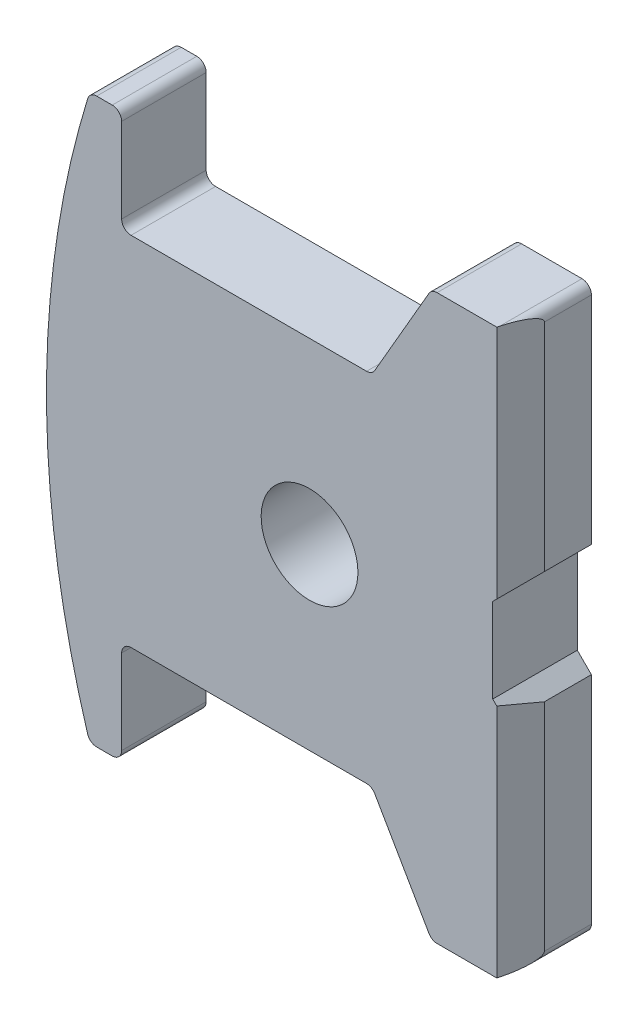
ISO-10303-21;
HEADER;
FILE_DESCRIPTION(('STEP AP214'),'2;1');
FILE_NAME('part.step','',(''),(''),'','','');
FILE_SCHEMA(('AUTOMOTIVE_DESIGN { 1 0 10303 214 1 1 1 1 }'));
ENDSEC;
DATA;
#1=APPLICATION_CONTEXT('core data for automotive mechanical design processes');
#2=APPLICATION_PROTOCOL_DEFINITION('international standard','automotive_design',2000,#1);
#3=PRODUCT_CONTEXT('',#1,'mechanical');
#4=PRODUCT('Part','Part','',(#3));
#5=PRODUCT_RELATED_PRODUCT_CATEGORY('part','',(#4));
#6=PRODUCT_DEFINITION_FORMATION('','',#4);
#7=PRODUCT_DEFINITION_CONTEXT('part definition',#1,'design');
#8=PRODUCT_DEFINITION('design','',#6,#7);
#9=PRODUCT_DEFINITION_SHAPE('','',#8);
#10=(LENGTH_UNIT() NAMED_UNIT(*) SI_UNIT(.MILLI.,.METRE.));
#11=(NAMED_UNIT(*) PLANE_ANGLE_UNIT() SI_UNIT($,.RADIAN.));
#12=(NAMED_UNIT(*) SI_UNIT($,.STERADIAN.) SOLID_ANGLE_UNIT());
#13=UNCERTAINTY_MEASURE_WITH_UNIT(LENGTH_MEASURE(1.E-05),#10,'distance_accuracy_value','');
#14=(GEOMETRIC_REPRESENTATION_CONTEXT(3) GLOBAL_UNCERTAINTY_ASSIGNED_CONTEXT((#13)) GLOBAL_UNIT_ASSIGNED_CONTEXT((#10,
#11,#12)) REPRESENTATION_CONTEXT('',''));
#15=CARTESIAN_POINT('',(0.,0.,0.));
#16=DIRECTION('',(0.,0.,1.));
#17=DIRECTION('',(1.,0.,0.));
#18=AXIS2_PLACEMENT_3D('',#15,#16,#17);
#19=CARTESIAN_POINT('',(-40.,-20.,9.));
#20=DIRECTION('',(0.,0.,-1.));
#21=DIRECTION('',(0.,-1.,0.));
#22=AXIS2_PLACEMENT_3D('',#19,#20,#21);
#23=CYLINDRICAL_SURFACE('',#22,1.);
#24=CARTESIAN_POINT('',(-40.,-20.,0.));
#25=DIRECTION('',(0.,0.,-1.));
#26=DIRECTION('',(0.,1.,0.));
#27=AXIS2_PLACEMENT_3D('',#24,#25,#26);
#28=CIRCLE('',#27,1.);
#29=CARTESIAN_POINT('',(-41.,-20.,0.));
#30=VERTEX_POINT('',#29);
#31=CARTESIAN_POINT('',(-40.,-19.,0.));
#32=VERTEX_POINT('',#31);
#33=EDGE_CURVE('E338',#30,#32,#28,.T.);
#34=ORIENTED_EDGE('',*,*,#33,.T.);
#35=DIRECTION('',(0.,0.,-1.));
#36=VECTOR('',#35,1.);
#37=CARTESIAN_POINT('',(-40.,-19.,9.));
#38=LINE('',#37,#36);
#39=CARTESIAN_POINT('',(-40.,-19.,9.));
#40=VERTEX_POINT('',#39);
#41=EDGE_CURVE('E261',#40,#32,#38,.T.);
#42=ORIENTED_EDGE('',*,*,#41,.F.);
#43=CARTESIAN_POINT('',(-40.,-20.,9.));
#44=DIRECTION('',(0.,0.,-1.));
#45=DIRECTION('',(0.,1.,0.));
#46=AXIS2_PLACEMENT_3D('',#43,#44,#45);
#47=CIRCLE('',#46,1.);
#48=CARTESIAN_POINT('',(-41.,-20.,9.));
#49=VERTEX_POINT('',#48);
#50=EDGE_CURVE('E339',#49,#40,#47,.T.);
#51=ORIENTED_EDGE('',*,*,#50,.F.);
#52=DIRECTION('',(0.,0.,-1.));
#53=VECTOR('',#52,1.);
#54=CARTESIAN_POINT('',(-41.,-20.,9.));
#55=LINE('',#54,#53);
#56=EDGE_CURVE('E380',#49,#30,#55,.T.);
#57=ORIENTED_EDGE('',*,*,#56,.T.);
#58=EDGE_LOOP('',(#34,#42,#51,#57));
#59=FACE_BOUND('',#58,.T.);
#60=ADVANCED_FACE('F14',(#59),#23,.F.);
#61=CARTESIAN_POINT('',(-14.9282032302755,-19.,9.));
#62=DIRECTION('',(0.,1.,0.));
#63=DIRECTION('',(-1.,0.,0.));
#64=AXIS2_PLACEMENT_3D('',#61,#62,#63);
#65=PLANE('',#64);
#66=DIRECTION('',(1.,0.,0.));
#67=VECTOR('',#66,1.);
#68=CARTESIAN_POINT('',(-14.9282032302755,-19.,0.));
#69=LINE('',#68,#67);
#70=CARTESIAN_POINT('',(-14.9282032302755,-19.,0.));
#71=VERTEX_POINT('',#70);
#72=EDGE_CURVE('E383',#32,#71,#69,.T.);
#73=ORIENTED_EDGE('',*,*,#72,.T.);
#74=DIRECTION('',(0.,0.,-1.));
#75=VECTOR('',#74,1.);
#76=CARTESIAN_POINT('',(-14.9282032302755,-19.,9.));
#77=LINE('',#76,#75);
#78=CARTESIAN_POINT('',(-14.9282032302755,-19.,9.));
#79=VERTEX_POINT('',#78);
#80=EDGE_CURVE('E258',#79,#71,#77,.T.);
#81=ORIENTED_EDGE('',*,*,#80,.F.);
#82=DIRECTION('',(1.,0.,0.));
#83=VECTOR('',#82,1.);
#84=CARTESIAN_POINT('',(-14.9282032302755,-19.,9.));
#85=LINE('',#84,#83);
#86=EDGE_CURVE('E342',#40,#79,#85,.T.);
#87=ORIENTED_EDGE('',*,*,#86,.F.);
#88=ORIENTED_EDGE('',*,*,#41,.T.);
#89=EDGE_LOOP('',(#73,#81,#87,#88));
#90=FACE_BOUND('',#89,.T.);
#91=ADVANCED_FACE('F510',(#90),#65,.F.);
#92=CARTESIAN_POINT('',(-14.9282032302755,-20.,9.));
#93=DIRECTION('',(0.,0.,-1.));
#94=DIRECTION('',(0.,-1.,0.));
#95=AXIS2_PLACEMENT_3D('',#92,#93,#94);
#96=CYLINDRICAL_SURFACE('',#95,1.);
#97=CARTESIAN_POINT('',(-14.9282032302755,-20.,0.));
#98=DIRECTION('',(0.,0.,-1.));
#99=DIRECTION('',(0.,1.,0.));
#100=AXIS2_PLACEMENT_3D('',#97,#98,#99);
#101=CIRCLE('',#100,1.);
#102=CARTESIAN_POINT('',(-14.062177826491,-19.5,0.));
#103=VERTEX_POINT('',#102);
#104=EDGE_CURVE('E385',#71,#103,#101,.T.);
#105=ORIENTED_EDGE('',*,*,#104,.T.);
#106=DIRECTION('',(0.,0.,-1.));
#107=VECTOR('',#106,1.);
#108=CARTESIAN_POINT('',(-14.062177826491,-19.5,9.));
#109=LINE('',#108,#107);
#110=CARTESIAN_POINT('',(-14.062177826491,-19.5,9.));
#111=VERTEX_POINT('',#110);
#112=EDGE_CURVE('E255',#111,#103,#109,.T.);
#113=ORIENTED_EDGE('',*,*,#112,.F.);
#114=CARTESIAN_POINT('',(-14.9282032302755,-20.,9.));
#115=DIRECTION('',(0.,0.,-1.));
#116=DIRECTION('',(0.,1.,0.));
#117=AXIS2_PLACEMENT_3D('',#114,#115,#116);
#118=CIRCLE('',#117,1.);
#119=EDGE_CURVE('E345',#79,#111,#118,.T.);
#120=ORIENTED_EDGE('',*,*,#119,.F.);
#121=ORIENTED_EDGE('',*,*,#80,.T.);
#122=EDGE_LOOP('',(#105,#113,#120,#121));
#123=FACE_BOUND('',#122,.T.);
#124=ADVANCED_FACE('F516',(#123),#96,.F.);
#125=CARTESIAN_POINT('',(-8.2886751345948,-29.5,9.));
#126=DIRECTION('',(0.866025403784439,0.5,0.));
#127=DIRECTION('',(-0.5,0.86602540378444,0.));
#128=AXIS2_PLACEMENT_3D('',#125,#126,#127);
#129=PLANE('',#128);
#130=DIRECTION('',(0.5,-0.86602540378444,0.));
#131=VECTOR('',#130,1.);
#132=CARTESIAN_POINT('',(-8.2886751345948,-29.5,0.));
#133=LINE('',#132,#131);
#134=CARTESIAN_POINT('',(-8.2886751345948,-29.5,0.));
#135=VERTEX_POINT('',#134);
#136=EDGE_CURVE('E387',#103,#135,#133,.T.);
#137=ORIENTED_EDGE('',*,*,#136,.T.);
#138=DIRECTION('',(0.,0.,-1.));
#139=VECTOR('',#138,1.);
#140=CARTESIAN_POINT('',(-8.2886751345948,-29.5,9.));
#141=LINE('',#140,#139);
#142=CARTESIAN_POINT('',(-8.2886751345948,-29.5,9.));
#143=VERTEX_POINT('',#142);
#144=EDGE_CURVE('E246',#143,#135,#141,.T.);
#145=ORIENTED_EDGE('',*,*,#144,.F.);
#146=DIRECTION('',(0.5,-0.86602540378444,0.));
#147=VECTOR('',#146,1.);
#148=CARTESIAN_POINT('',(-8.2886751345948,-29.5,9.));
#149=LINE('',#148,#147);
#150=EDGE_CURVE('E347',#111,#143,#149,.T.);
#151=ORIENTED_EDGE('',*,*,#150,.F.);
#152=ORIENTED_EDGE('',*,*,#112,.T.);
#153=EDGE_LOOP('',(#137,#145,#151,#152));
#154=FACE_BOUND('',#153,.T.);
#155=ADVANCED_FACE('F522',(#154),#129,.F.);
#156=CARTESIAN_POINT('',(-7.42264973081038,-29.,9.));
#157=DIRECTION('',(0.,0.,-1.));
#158=DIRECTION('',(0.,-1.,0.));
#159=AXIS2_PLACEMENT_3D('',#156,#157,#158);
#160=CYLINDRICAL_SURFACE('',#159,1.);
#161=CARTESIAN_POINT('',(-7.42264973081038,-29.,0.));
#162=DIRECTION('',(0.,0.,1.));
#163=DIRECTION('',(0.,-1.,0.));
#164=AXIS2_PLACEMENT_3D('',#161,#162,#163);
#165=CIRCLE('',#164,1.);
#166=CARTESIAN_POINT('',(-7.42264973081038,-30.,0.));
#167=VERTEX_POINT('',#166);
#168=EDGE_CURVE('E389',#135,#167,#165,.T.);
#169=ORIENTED_EDGE('',*,*,#168,.T.);
#170=DIRECTION('',(0.,0.,-1.));
#171=VECTOR('',#170,1.);
#172=CARTESIAN_POINT('',(-7.42264973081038,-30.,9.));
#173=LINE('',#172,#171);
#174=CARTESIAN_POINT('',(-7.42264973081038,-30.,9.));
#175=VERTEX_POINT('',#174);
#176=EDGE_CURVE('E242',#175,#167,#173,.T.);
#177=ORIENTED_EDGE('',*,*,#176,.F.);
#178=CARTESIAN_POINT('',(-7.42264973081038,-29.,9.));
#179=DIRECTION('',(0.,0.,1.));
#180=DIRECTION('',(0.,-1.,0.));
#181=AXIS2_PLACEMENT_3D('',#178,#179,#180);
#182=CIRCLE('',#181,1.);
#183=EDGE_CURVE('E349',#143,#175,#182,.T.);
#184=ORIENTED_EDGE('',*,*,#183,.F.);
#185=ORIENTED_EDGE('',*,*,#144,.T.);
#186=EDGE_LOOP('',(#169,#177,#184,#185));
#187=FACE_BOUND('',#186,.T.);
#188=ADVANCED_FACE('F526',(#187),#160,.T.);
#189=CARTESIAN_POINT('',(0.,-30.,9.));
#190=DIRECTION('',(0.,1.,0.));
#191=DIRECTION('',(-1.,0.,0.));
#192=AXIS2_PLACEMENT_3D('',#189,#190,#191);
#193=PLANE('',#192);
#194=DIRECTION('',(1.,0.,0.));
#195=VECTOR('',#194,1.);
#196=CARTESIAN_POINT('',(0.,-30.,0.));
#197=LINE('',#196,#195);
#198=CARTESIAN_POINT('',(-1.,-30.,0.));
#199=VERTEX_POINT('',#198);
#200=EDGE_CURVE('E391',#167,#199,#197,.T.);
#201=ORIENTED_EDGE('',*,*,#200,.T.);
#202=DIRECTION('',(0.,0.,-1.));
#203=VECTOR('',#202,1.);
#204=CARTESIAN_POINT('',(-1.,-30.,9.));
#205=LINE('',#204,#203);
#206=CARTESIAN_POINT('',(-1.,-30.,8.73205080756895));
#207=VERTEX_POINT('',#206);
#208=EDGE_CURVE('E273',#199,#207,#205,.F.);
#209=ORIENTED_EDGE('',*,*,#208,.T.);
#210=DIRECTION('',(-0.258819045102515,0.,0.96592582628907));
#211=VECTOR('',#210,1.);
#212=CARTESIAN_POINT('',(-1.,-30.,8.73205080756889));
#213=LINE('',#212,#211);
#214=CARTESIAN_POINT('',(-1.07179676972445,-30.,9.));
#215=VERTEX_POINT('',#214);
#216=EDGE_CURVE('E236',#207,#215,#213,.T.);
#217=ORIENTED_EDGE('',*,*,#216,.T.);
#218=DIRECTION('',(1.,0.,0.));
#219=VECTOR('',#218,1.);
#220=CARTESIAN_POINT('',(0.,-30.,9.));
#221=LINE('',#220,#219);
#222=EDGE_CURVE('E351',#175,#215,#221,.T.);
#223=ORIENTED_EDGE('',*,*,#222,.F.);
#224=ORIENTED_EDGE('',*,*,#176,.T.);
#225=EDGE_LOOP('',(#201,#209,#217,#223,#224));
#226=FACE_BOUND('',#225,.T.);
#227=ADVANCED_FACE('F493',(#226),#193,.F.);
#228=CARTESIAN_POINT('',(0.,-6.,9.));
#229=DIRECTION('',(-1.,0.,0.));
#230=DIRECTION('',(0.,-1.,0.));
#231=AXIS2_PLACEMENT_3D('',#228,#229,#230);
#232=PLANE('',#231);
#233=DIRECTION('',(0.,1.,0.));
#234=VECTOR('',#233,1.);
#235=CARTESIAN_POINT('',(0.,-40.,5.));
#236=LINE('',#235,#234);
#237=CARTESIAN_POINT('',(0.,-29.,5.));
#238=VERTEX_POINT('',#237);
#239=CARTESIAN_POINT('',(0.,-6.,5.));
#240=VERTEX_POINT('',#239);
#241=EDGE_CURVE('E212',#238,#240,#236,.T.);
#242=ORIENTED_EDGE('',*,*,#241,.F.);
#243=DIRECTION('',(0.,0.,-1.));
#244=VECTOR('',#243,1.);
#245=CARTESIAN_POINT('',(0.,-29.,9.));
#246=LINE('',#245,#244);
#247=CARTESIAN_POINT('',(0.,-29.,0.));
#248=VERTEX_POINT('',#247);
#249=EDGE_CURVE('E267',#238,#248,#246,.T.);
#250=ORIENTED_EDGE('',*,*,#249,.T.);
#251=DIRECTION('',(0.,1.,0.));
#252=VECTOR('',#251,1.);
#253=CARTESIAN_POINT('',(0.,-6.,0.));
#254=LINE('',#253,#252);
#255=CARTESIAN_POINT('',(0.,-6.,0.));
#256=VERTEX_POINT('',#255);
#257=EDGE_CURVE('E241',#248,#256,#254,.T.);
#258=ORIENTED_EDGE('',*,*,#257,.T.);
#259=DIRECTION('',(0.,0.,-1.));
#260=VECTOR('',#259,1.);
#261=CARTESIAN_POINT('',(0.,-6.,9.));
#262=LINE('',#261,#260);
#263=EDGE_CURVE('E232',#240,#256,#262,.T.);
#264=ORIENTED_EDGE('',*,*,#263,.F.);
#265=EDGE_LOOP('',(#242,#250,#258,#264));
#266=FACE_BOUND('',#265,.T.);
#267=ADVANCED_FACE('F239',(#266),#232,.F.);
#268=CARTESIAN_POINT('',(0.,-6.,9.));
#269=DIRECTION('',(-0.707106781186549,-0.707106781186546,0.));
#270=DIRECTION('',(0.707106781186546,-0.707106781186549,0.));
#271=AXIS2_PLACEMENT_3D('',#268,#269,#270);
#272=PLANE('',#271);
#273=DIRECTION('',(-0.707106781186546,0.707106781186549,0.));
#274=VECTOR('',#273,1.);
#275=CARTESIAN_POINT('',(0.,-6.,9.));
#276=LINE('',#275,#274);
#277=CARTESIAN_POINT('',(-1.07179676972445,-4.92820323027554,9.));
#278=VERTEX_POINT('',#277);
#279=CARTESIAN_POINT('',(-1.5,-4.5,9.));
#280=VERTEX_POINT('',#279);
#281=EDGE_CURVE('E235',#278,#280,#276,.T.);
#282=ORIENTED_EDGE('',*,*,#281,.F.);
#283=DIRECTION('',(0.250562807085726,-0.250562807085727,-0.935113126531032));
#284=VECTOR('',#283,1.);
#285=CARTESIAN_POINT('',(-0.937218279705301,-5.0627817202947,8.49774623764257));
#286=LINE('',#285,#284);
#287=EDGE_CURVE('E217',#278,#240,#286,.T.);
#288=ORIENTED_EDGE('',*,*,#287,.T.);
#289=ORIENTED_EDGE('',*,*,#263,.T.);
#290=DIRECTION('',(-0.707106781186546,0.707106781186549,0.));
#291=VECTOR('',#290,1.);
#292=CARTESIAN_POINT('',(0.,-6.,0.));
#293=LINE('',#292,#291);
#294=CARTESIAN_POINT('',(-1.5,-4.5,0.));
#295=VERTEX_POINT('',#294);
#296=EDGE_CURVE('E395',#256,#295,#293,.T.);
#297=ORIENTED_EDGE('',*,*,#296,.T.);
#298=DIRECTION('',(0.,0.,-1.));
#299=VECTOR('',#298,1.);
#300=CARTESIAN_POINT('',(-1.5,-4.5,9.));
#301=LINE('',#300,#299);
#302=EDGE_CURVE('E243',#280,#295,#301,.T.);
#303=ORIENTED_EDGE('',*,*,#302,.F.);
#304=EDGE_LOOP('',(#282,#288,#289,#297,#303));
#305=FACE_BOUND('',#304,.T.);
#306=ADVANCED_FACE('F231',(#305),#272,.F.);
#307=CARTESIAN_POINT('',(-1.5,-4.5,9.));
#308=DIRECTION('',(-1.,0.,0.));
#309=DIRECTION('',(0.,-1.,0.));
#310=AXIS2_PLACEMENT_3D('',#307,#308,#309);
#311=PLANE('',#310);
#312=DIRECTION('',(0.,1.,0.));
#313=VECTOR('',#312,1.);
#314=CARTESIAN_POINT('',(-1.5,-4.5,0.));
#315=LINE('',#314,#313);
#316=CARTESIAN_POINT('',(-1.5,4.5,0.));
#317=VERTEX_POINT('',#316);
#318=EDGE_CURVE('E397',#295,#317,#315,.T.);
#319=ORIENTED_EDGE('',*,*,#318,.T.);
#320=DIRECTION('',(0.,0.,-1.));
#321=VECTOR('',#320,1.);
#322=CARTESIAN_POINT('',(-1.5,4.5,9.));
#323=LINE('',#322,#321);
#324=CARTESIAN_POINT('',(-1.5,4.5,9.));
#325=VERTEX_POINT('',#324);
#326=EDGE_CURVE('E249',#325,#317,#323,.T.);
#327=ORIENTED_EDGE('',*,*,#326,.F.);
#328=DIRECTION('',(0.,1.,0.));
#329=VECTOR('',#328,1.);
#330=CARTESIAN_POINT('',(-1.5,-4.5,9.));
#331=LINE('',#330,#329);
#332=EDGE_CURVE('E355',#280,#325,#331,.T.);
#333=ORIENTED_EDGE('',*,*,#332,.F.);
#334=ORIENTED_EDGE('',*,*,#302,.T.);
#335=EDGE_LOOP('',(#319,#327,#333,#334));
#336=FACE_BOUND('',#335,.T.);
#337=ADVANCED_FACE('F487',(#336),#311,.F.);
#338=CARTESIAN_POINT('',(0.,6.,9.));
#339=DIRECTION('',(-0.707106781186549,0.707106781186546,0.));
#340=DIRECTION('',(-0.707106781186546,-0.707106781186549,0.));
#341=AXIS2_PLACEMENT_3D('',#338,#339,#340);
#342=PLANE('',#341);
#343=DIRECTION('',(0.,0.,-1.));
#344=VECTOR('',#343,1.);
#345=CARTESIAN_POINT('',(0.,6.,9.));
#346=LINE('',#345,#344);
#347=CARTESIAN_POINT('',(0.,6.,5.));
#348=VERTEX_POINT('',#347);
#349=CARTESIAN_POINT('',(0.,6.,0.));
#350=VERTEX_POINT('',#349);
#351=EDGE_CURVE('E457',#348,#350,#346,.T.);
#352=ORIENTED_EDGE('',*,*,#351,.F.);
#353=DIRECTION('',(-0.250562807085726,-0.250562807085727,0.935113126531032));
#354=VECTOR('',#353,1.);
#355=CARTESIAN_POINT('',(-0.937218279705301,5.06278172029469,8.49774623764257));
#356=LINE('',#355,#354);
#357=CARTESIAN_POINT('',(-1.07179676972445,4.92820323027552,9.));
#358=VERTEX_POINT('',#357);
#359=EDGE_CURVE('E237',#348,#358,#356,.T.);
#360=ORIENTED_EDGE('',*,*,#359,.T.);
#361=DIRECTION('',(0.707106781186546,0.707106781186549,0.));
#362=VECTOR('',#361,1.);
#363=CARTESIAN_POINT('',(0.,6.,9.));
#364=LINE('',#363,#362);
#365=EDGE_CURVE('E357',#325,#358,#364,.T.);
#366=ORIENTED_EDGE('',*,*,#365,.F.);
#367=ORIENTED_EDGE('',*,*,#326,.T.);
#368=DIRECTION('',(0.707106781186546,0.707106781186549,0.));
#369=VECTOR('',#368,1.);
#370=CARTESIAN_POINT('',(0.,6.,0.));
#371=LINE('',#370,#369);
#372=EDGE_CURVE('E399',#317,#350,#371,.T.);
#373=ORIENTED_EDGE('',*,*,#372,.T.);
#374=EDGE_LOOP('',(#352,#360,#366,#367,#373));
#375=FACE_BOUND('',#374,.T.);
#376=ADVANCED_FACE('F464',(#375),#342,.F.);
#377=CARTESIAN_POINT('',(0.,30.,9.));
#378=DIRECTION('',(-1.,0.,0.));
#379=DIRECTION('',(0.,-1.,0.));
#380=AXIS2_PLACEMENT_3D('',#377,#378,#379);
#381=PLANE('',#380);
#382=DIRECTION('',(0.,1.,0.));
#383=VECTOR('',#382,1.);
#384=CARTESIAN_POINT('',(0.,30.,0.));
#385=LINE('',#384,#383);
#386=CARTESIAN_POINT('',(0.,29.,0.));
#387=VERTEX_POINT('',#386);
#388=EDGE_CURVE('E402',#350,#387,#385,.T.);
#389=ORIENTED_EDGE('',*,*,#388,.T.);
#390=DIRECTION('',(0.,0.,-1.));
#391=VECTOR('',#390,1.);
#392=CARTESIAN_POINT('',(0.,29.,9.));
#393=LINE('',#392,#391);
#394=CARTESIAN_POINT('',(0.,29.,5.));
#395=VERTEX_POINT('',#394);
#396=EDGE_CURVE('E279',#387,#395,#393,.F.);
#397=ORIENTED_EDGE('',*,*,#396,.T.);
#398=EDGE_CURVE('E226',#348,#395,#236,.T.);
#399=ORIENTED_EDGE('',*,*,#398,.F.);
#400=ORIENTED_EDGE('',*,*,#351,.T.);
#401=EDGE_LOOP('',(#389,#397,#399,#400));
#402=FACE_BOUND('',#401,.T.);
#403=ADVANCED_FACE('F472',(#402),#381,.F.);
#404=CARTESIAN_POINT('',(-7.42264973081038,30.,9.));
#405=DIRECTION('',(0.,-1.,0.));
#406=DIRECTION('',(1.,0.,0.));
#407=AXIS2_PLACEMENT_3D('',#404,#405,#406);
#408=PLANE('',#407);
#409=DIRECTION('',(0.258819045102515,0.,-0.96592582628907));
#410=VECTOR('',#409,1.);
#411=CARTESIAN_POINT('',(-1.4972232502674,30.,10.5877132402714));
#412=LINE('',#411,#410);
#413=CARTESIAN_POINT('',(-1.07179676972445,30.,9.));
#414=VERTEX_POINT('',#413);
#415=CARTESIAN_POINT('',(-1.,30.,8.73205080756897));
#416=VERTEX_POINT('',#415);
#417=EDGE_CURVE('E225',#414,#416,#412,.T.);
#418=ORIENTED_EDGE('',*,*,#417,.T.);
#419=DIRECTION('',(0.,0.,-1.));
#420=VECTOR('',#419,1.);
#421=CARTESIAN_POINT('',(-1.,30.,9.));
#422=LINE('',#421,#420);
#423=CARTESIAN_POINT('',(-1.,30.,0.));
#424=VERTEX_POINT('',#423);
#425=EDGE_CURVE('E276',#416,#424,#422,.T.);
#426=ORIENTED_EDGE('',*,*,#425,.T.);
#427=DIRECTION('',(-1.,0.,0.));
#428=VECTOR('',#427,1.);
#429=CARTESIAN_POINT('',(-7.42264973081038,30.,0.));
#430=LINE('',#429,#428);
#431=CARTESIAN_POINT('',(-7.42264973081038,30.,0.));
#432=VERTEX_POINT('',#431);
#433=EDGE_CURVE('E405',#424,#432,#430,.T.);
#434=ORIENTED_EDGE('',*,*,#433,.T.);
#435=DIRECTION('',(0.,0.,-1.));
#436=VECTOR('',#435,1.);
#437=CARTESIAN_POINT('',(-7.42264973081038,30.,9.));
#438=LINE('',#437,#436);
#439=CARTESIAN_POINT('',(-7.42264973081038,30.,9.));
#440=VERTEX_POINT('',#439);
#441=EDGE_CURVE('E454',#440,#432,#438,.T.);
#442=ORIENTED_EDGE('',*,*,#441,.F.);
#443=DIRECTION('',(-1.,0.,0.));
#444=VECTOR('',#443,1.);
#445=CARTESIAN_POINT('',(-7.42264973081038,30.,9.));
#446=LINE('',#445,#444);
#447=EDGE_CURVE('E360',#414,#440,#446,.T.);
#448=ORIENTED_EDGE('',*,*,#447,.F.);
#449=EDGE_LOOP('',(#418,#426,#434,#442,#448));
#450=FACE_BOUND('',#449,.T.);
#451=ADVANCED_FACE('F483',(#450),#408,.F.);
#452=CARTESIAN_POINT('',(-7.42264973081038,29.,9.));
#453=DIRECTION('',(0.,0.,-1.));
#454=DIRECTION('',(0.,-1.,0.));
#455=AXIS2_PLACEMENT_3D('',#452,#453,#454);
#456=CYLINDRICAL_SURFACE('',#455,1.);
#457=CARTESIAN_POINT('',(-7.42264973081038,29.,0.));
#458=DIRECTION('',(0.,0.,1.));
#459=DIRECTION('',(0.,1.,0.));
#460=AXIS2_PLACEMENT_3D('',#457,#458,#459);
#461=CIRCLE('',#460,1.);
#462=CARTESIAN_POINT('',(-8.2886751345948,29.5,0.));
#463=VERTEX_POINT('',#462);
#464=EDGE_CURVE('E407',#432,#463,#461,.T.);
#465=ORIENTED_EDGE('',*,*,#464,.T.);
#466=DIRECTION('',(0.,0.,-1.));
#467=VECTOR('',#466,1.);
#468=CARTESIAN_POINT('',(-8.2886751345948,29.5,9.));
#469=LINE('',#468,#467);
#470=CARTESIAN_POINT('',(-8.2886751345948,29.5,9.));
#471=VERTEX_POINT('',#470);
#472=EDGE_CURVE('E451',#471,#463,#469,.T.);
#473=ORIENTED_EDGE('',*,*,#472,.F.);
#474=CARTESIAN_POINT('',(-7.42264973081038,29.,9.));
#475=DIRECTION('',(0.,0.,1.));
#476=DIRECTION('',(0.,1.,0.));
#477=AXIS2_PLACEMENT_3D('',#474,#475,#476);
#478=CIRCLE('',#477,1.);
#479=EDGE_CURVE('E362',#440,#471,#478,.T.);
#480=ORIENTED_EDGE('',*,*,#479,.F.);
#481=ORIENTED_EDGE('',*,*,#441,.T.);
#482=EDGE_LOOP('',(#465,#473,#480,#481));
#483=FACE_BOUND('',#482,.T.);
#484=ADVANCED_FACE('F545',(#483),#456,.T.);
#485=CARTESIAN_POINT('',(-14.062177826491,19.5,9.));
#486=DIRECTION('',(0.86602540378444,-0.5,0.));
#487=DIRECTION('',(0.5,0.86602540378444,0.));
#488=AXIS2_PLACEMENT_3D('',#485,#486,#487);
#489=PLANE('',#488);
#490=DIRECTION('',(-0.5,-0.86602540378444,0.));
#491=VECTOR('',#490,1.);
#492=CARTESIAN_POINT('',(-14.062177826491,19.5,0.));
#493=LINE('',#492,#491);
#494=CARTESIAN_POINT('',(-14.062177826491,19.5,0.));
#495=VERTEX_POINT('',#494);
#496=EDGE_CURVE('E409',#463,#495,#493,.T.);
#497=ORIENTED_EDGE('',*,*,#496,.T.);
#498=DIRECTION('',(0.,0.,-1.));
#499=VECTOR('',#498,1.);
#500=CARTESIAN_POINT('',(-14.062177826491,19.5,9.));
#501=LINE('',#500,#499);
#502=CARTESIAN_POINT('',(-14.062177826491,19.5,9.));
#503=VERTEX_POINT('',#502);
#504=EDGE_CURVE('E448',#503,#495,#501,.T.);
#505=ORIENTED_EDGE('',*,*,#504,.F.);
#506=DIRECTION('',(-0.5,-0.86602540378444,0.));
#507=VECTOR('',#506,1.);
#508=CARTESIAN_POINT('',(-14.062177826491,19.5,9.));
#509=LINE('',#508,#507);
#510=EDGE_CURVE('E364',#471,#503,#509,.T.);
#511=ORIENTED_EDGE('',*,*,#510,.F.);
#512=ORIENTED_EDGE('',*,*,#472,.T.);
#513=EDGE_LOOP('',(#497,#505,#511,#512));
#514=FACE_BOUND('',#513,.T.);
#515=ADVANCED_FACE('F548',(#514),#489,.F.);
#516=CARTESIAN_POINT('',(-14.9282032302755,20.,9.));
#517=DIRECTION('',(0.,0.,-1.));
#518=DIRECTION('',(0.,-1.,0.));
#519=AXIS2_PLACEMENT_3D('',#516,#517,#518);
#520=CYLINDRICAL_SURFACE('',#519,1.);
#521=CARTESIAN_POINT('',(-14.9282032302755,20.,0.));
#522=DIRECTION('',(0.,0.,-1.));
#523=DIRECTION('',(0.,-1.,0.));
#524=AXIS2_PLACEMENT_3D('',#521,#522,#523);
#525=CIRCLE('',#524,1.);
#526=CARTESIAN_POINT('',(-14.9282032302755,19.,0.));
#527=VERTEX_POINT('',#526);
#528=EDGE_CURVE('E411',#495,#527,#525,.T.);
#529=ORIENTED_EDGE('',*,*,#528,.T.);
#530=DIRECTION('',(0.,0.,-1.));
#531=VECTOR('',#530,1.);
#532=CARTESIAN_POINT('',(-14.9282032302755,19.,9.));
#533=LINE('',#532,#531);
#534=CARTESIAN_POINT('',(-14.9282032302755,19.,9.));
#535=VERTEX_POINT('',#534);
#536=EDGE_CURVE('E445',#535,#527,#533,.T.);
#537=ORIENTED_EDGE('',*,*,#536,.F.);
#538=CARTESIAN_POINT('',(-14.9282032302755,20.,9.));
#539=DIRECTION('',(0.,0.,-1.));
#540=DIRECTION('',(0.,-1.,0.));
#541=AXIS2_PLACEMENT_3D('',#538,#539,#540);
#542=CIRCLE('',#541,1.);
#543=EDGE_CURVE('E366',#503,#535,#542,.T.);
#544=ORIENTED_EDGE('',*,*,#543,.F.);
#545=ORIENTED_EDGE('',*,*,#504,.T.);
#546=EDGE_LOOP('',(#529,#537,#544,#545));
#547=FACE_BOUND('',#546,.T.);
#548=ADVANCED_FACE('F552',(#547),#520,.F.);
#549=CARTESIAN_POINT('',(-40.,19.,9.));
#550=DIRECTION('',(0.,-1.,0.));
#551=DIRECTION('',(1.,0.,0.));
#552=AXIS2_PLACEMENT_3D('',#549,#550,#551);
#553=PLANE('',#552);
#554=DIRECTION('',(-1.,0.,0.));
#555=VECTOR('',#554,1.);
#556=CARTESIAN_POINT('',(-40.,19.,0.));
#557=LINE('',#556,#555);
#558=CARTESIAN_POINT('',(-40.,19.,0.));
#559=VERTEX_POINT('',#558);
#560=EDGE_CURVE('E413',#527,#559,#557,.T.);
#561=ORIENTED_EDGE('',*,*,#560,.T.);
#562=DIRECTION('',(0.,0.,-1.));
#563=VECTOR('',#562,1.);
#564=CARTESIAN_POINT('',(-40.,19.,9.));
#565=LINE('',#564,#563);
#566=CARTESIAN_POINT('',(-40.,19.,9.));
#567=VERTEX_POINT('',#566);
#568=EDGE_CURVE('E442',#567,#559,#565,.T.);
#569=ORIENTED_EDGE('',*,*,#568,.F.);
#570=DIRECTION('',(-1.,0.,0.));
#571=VECTOR('',#570,1.);
#572=CARTESIAN_POINT('',(-40.,19.,9.));
#573=LINE('',#572,#571);
#574=EDGE_CURVE('E368',#535,#567,#573,.T.);
#575=ORIENTED_EDGE('',*,*,#574,.F.);
#576=ORIENTED_EDGE('',*,*,#536,.T.);
#577=EDGE_LOOP('',(#561,#569,#575,#576));
#578=FACE_BOUND('',#577,.T.);
#579=ADVANCED_FACE('F556',(#578),#553,.F.);
#580=CARTESIAN_POINT('',(-40.,20.,9.));
#581=DIRECTION('',(0.,0.,-1.));
#582=DIRECTION('',(0.,-1.,0.));
#583=AXIS2_PLACEMENT_3D('',#580,#581,#582);
#584=CYLINDRICAL_SURFACE('',#583,1.);
#585=CARTESIAN_POINT('',(-40.,20.,0.));
#586=DIRECTION('',(0.,0.,-1.));
#587=DIRECTION('',(0.,-1.,0.));
#588=AXIS2_PLACEMENT_3D('',#585,#586,#587);
#589=CIRCLE('',#588,1.);
#590=CARTESIAN_POINT('',(-41.,20.,0.));
#591=VERTEX_POINT('',#590);
#592=EDGE_CURVE('E415',#559,#591,#589,.T.);
#593=ORIENTED_EDGE('',*,*,#592,.T.);
#594=DIRECTION('',(0.,0.,-1.));
#595=VECTOR('',#594,1.);
#596=CARTESIAN_POINT('',(-41.,20.,9.));
#597=LINE('',#596,#595);
#598=CARTESIAN_POINT('',(-41.,20.,9.));
#599=VERTEX_POINT('',#598);
#600=EDGE_CURVE('E439',#599,#591,#597,.T.);
#601=ORIENTED_EDGE('',*,*,#600,.F.);
#602=CARTESIAN_POINT('',(-40.,20.,9.));
#603=DIRECTION('',(0.,0.,-1.));
#604=DIRECTION('',(0.,-1.,0.));
#605=AXIS2_PLACEMENT_3D('',#602,#603,#604);
#606=CIRCLE('',#605,1.);
#607=EDGE_CURVE('E370',#567,#599,#606,.T.);
#608=ORIENTED_EDGE('',*,*,#607,.F.);
#609=ORIENTED_EDGE('',*,*,#568,.T.);
#610=EDGE_LOOP('',(#593,#601,#608,#609));
#611=FACE_BOUND('',#610,.T.);
#612=ADVANCED_FACE('F560',(#611),#584,.F.);
#613=CARTESIAN_POINT('',(-41.,29.,9.));
#614=DIRECTION('',(-1.,0.,0.));
#615=DIRECTION('',(0.,-1.,0.));
#616=AXIS2_PLACEMENT_3D('',#613,#614,#615);
#617=PLANE('',#616);
#618=DIRECTION('',(0.,1.,0.));
#619=VECTOR('',#618,1.);
#620=CARTESIAN_POINT('',(-41.,29.,0.));
#621=LINE('',#620,#619);
#622=CARTESIAN_POINT('',(-41.,29.,0.));
#623=VERTEX_POINT('',#622);
#624=EDGE_CURVE('E417',#591,#623,#621,.T.);
#625=ORIENTED_EDGE('',*,*,#624,.T.);
#626=DIRECTION('',(0.,0.,-1.));
#627=VECTOR('',#626,1.);
#628=CARTESIAN_POINT('',(-41.,29.,9.));
#629=LINE('',#628,#627);
#630=CARTESIAN_POINT('',(-41.,29.,9.));
#631=VERTEX_POINT('',#630);
#632=EDGE_CURVE('E436',#631,#623,#629,.T.);
#633=ORIENTED_EDGE('',*,*,#632,.F.);
#634=DIRECTION('',(0.,1.,0.));
#635=VECTOR('',#634,1.);
#636=CARTESIAN_POINT('',(-41.,29.,9.));
#637=LINE('',#636,#635);
#638=EDGE_CURVE('E372',#599,#631,#637,.T.);
#639=ORIENTED_EDGE('',*,*,#638,.F.);
#640=ORIENTED_EDGE('',*,*,#600,.T.);
#641=EDGE_LOOP('',(#625,#633,#639,#640));
#642=FACE_BOUND('',#641,.T.);
#643=ADVANCED_FACE('F564',(#642),#617,.F.);
#644=CARTESIAN_POINT('',(-42.,29.,9.));
#645=DIRECTION('',(0.,0.,-1.));
#646=DIRECTION('',(0.,-1.,0.));
#647=AXIS2_PLACEMENT_3D('',#644,#645,#646);
#648=CYLINDRICAL_SURFACE('',#647,1.);
#649=CARTESIAN_POINT('',(-42.,29.,0.));
#650=DIRECTION('',(0.,0.,1.));
#651=DIRECTION('',(0.,1.,0.));
#652=AXIS2_PLACEMENT_3D('',#649,#650,#651);
#653=CIRCLE('',#652,1.);
#654=CARTESIAN_POINT('',(-42.,30.,0.));
#655=VERTEX_POINT('',#654);
#656=EDGE_CURVE('E419',#623,#655,#653,.T.);
#657=ORIENTED_EDGE('',*,*,#656,.T.);
#658=DIRECTION('',(0.,0.,-1.));
#659=VECTOR('',#658,1.);
#660=CARTESIAN_POINT('',(-42.,30.,9.));
#661=LINE('',#660,#659);
#662=CARTESIAN_POINT('',(-42.,30.,9.));
#663=VERTEX_POINT('',#662);
#664=EDGE_CURVE('E433',#663,#655,#661,.T.);
#665=ORIENTED_EDGE('',*,*,#664,.F.);
#666=CARTESIAN_POINT('',(-42.,29.,9.));
#667=DIRECTION('',(0.,0.,1.));
#668=DIRECTION('',(0.,1.,0.));
#669=AXIS2_PLACEMENT_3D('',#666,#667,#668);
#670=CIRCLE('',#669,1.);
#671=EDGE_CURVE('E374',#631,#663,#670,.T.);
#672=ORIENTED_EDGE('',*,*,#671,.F.);
#673=ORIENTED_EDGE('',*,*,#632,.T.);
#674=EDGE_LOOP('',(#657,#665,#672,#673));
#675=FACE_BOUND('',#674,.T.);
#676=ADVANCED_FACE('F568',(#675),#648,.T.);
#677=CARTESIAN_POINT('',(-42.,30.,9.));
#678=DIRECTION('',(0.,-1.,0.));
#679=DIRECTION('',(1.,0.,0.));
#680=AXIS2_PLACEMENT_3D('',#677,#678,#679);
#681=PLANE('',#680);
#682=DIRECTION('',(-1.,0.,0.));
#683=VECTOR('',#682,1.);
#684=CARTESIAN_POINT('',(-42.,30.,0.));
#685=LINE('',#684,#683);
#686=CARTESIAN_POINT('',(-43.6572765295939,30.,0.));
#687=VERTEX_POINT('',#686);
#688=EDGE_CURVE('E421',#655,#687,#685,.T.);
#689=ORIENTED_EDGE('',*,*,#688,.T.);
#690=DIRECTION('',(0.,0.,-1.));
#691=VECTOR('',#690,1.);
#692=CARTESIAN_POINT('',(-43.6572765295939,30.,9.));
#693=LINE('',#692,#691);
#694=CARTESIAN_POINT('',(-43.6572765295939,30.,9.));
#695=VERTEX_POINT('',#694);
#696=EDGE_CURVE('E9',#687,#695,#693,.F.);
#697=ORIENTED_EDGE('',*,*,#696,.T.);
#698=DIRECTION('',(-1.,0.,0.));
#699=VECTOR('',#698,1.);
#700=CARTESIAN_POINT('',(-42.,30.,9.));
#701=LINE('',#700,#699);
#702=EDGE_CURVE('E312',#663,#695,#701,.T.);
#703=ORIENTED_EDGE('',*,*,#702,.F.);
#704=ORIENTED_EDGE('',*,*,#664,.T.);
#705=EDGE_LOOP('',(#689,#697,#703,#704));
#706=FACE_BOUND('',#705,.T.);
#707=ADVANCED_FACE('F572',(#706),#681,.F.);
#708=CARTESIAN_POINT('',(-42.,-30.,9.));
#709=DIRECTION('',(0.,1.,0.));
#710=DIRECTION('',(-1.,0.,0.));
#711=AXIS2_PLACEMENT_3D('',#708,#709,#710);
#712=PLANE('',#711);
#713=DIRECTION('',(1.,0.,0.));
#714=VECTOR('',#713,1.);
#715=CARTESIAN_POINT('',(-42.,-30.,9.));
#716=LINE('',#715,#714);
#717=CARTESIAN_POINT('',(-43.6572765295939,-30.,9.));
#718=VERTEX_POINT('',#717);
#719=CARTESIAN_POINT('',(-42.,-30.,9.));
#720=VERTEX_POINT('',#719);
#721=EDGE_CURVE('E300',#718,#720,#716,.T.);
#722=ORIENTED_EDGE('',*,*,#721,.F.);
#723=DIRECTION('',(0.,0.,-1.));
#724=VECTOR('',#723,1.);
#725=CARTESIAN_POINT('',(-43.6572765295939,-30.,9.));
#726=LINE('',#725,#724);
#727=CARTESIAN_POINT('',(-43.6572765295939,-30.,0.));
#728=VERTEX_POINT('',#727);
#729=EDGE_CURVE('E283',#718,#728,#726,.T.);
#730=ORIENTED_EDGE('',*,*,#729,.T.);
#731=DIRECTION('',(1.,0.,0.));
#732=VECTOR('',#731,1.);
#733=CARTESIAN_POINT('',(-42.,-30.,0.));
#734=LINE('',#733,#732);
#735=CARTESIAN_POINT('',(-42.,-30.,0.));
#736=VERTEX_POINT('',#735);
#737=EDGE_CURVE('E320',#728,#736,#734,.T.);
#738=ORIENTED_EDGE('',*,*,#737,.T.);
#739=DIRECTION('',(0.,0.,-1.));
#740=VECTOR('',#739,1.);
#741=CARTESIAN_POINT('',(-42.,-30.,9.));
#742=LINE('',#741,#740);
#743=EDGE_CURVE('E309',#720,#736,#742,.T.);
#744=ORIENTED_EDGE('',*,*,#743,.F.);
#745=EDGE_LOOP('',(#722,#730,#738,#744));
#746=FACE_BOUND('',#745,.T.);
#747=ADVANCED_FACE('F306',(#746),#712,.F.);
#748=CARTESIAN_POINT('',(-42.,-29.,9.));
#749=DIRECTION('',(0.,0.,-1.));
#750=DIRECTION('',(0.,-1.,0.));
#751=AXIS2_PLACEMENT_3D('',#748,#749,#750);
#752=CYLINDRICAL_SURFACE('',#751,1.);
#753=CARTESIAN_POINT('',(-42.,-29.,0.));
#754=DIRECTION('',(0.,0.,1.));
#755=DIRECTION('',(0.,1.,0.));
#756=AXIS2_PLACEMENT_3D('',#753,#754,#755);
#757=CIRCLE('',#756,1.);
#758=CARTESIAN_POINT('',(-41.,-29.,0.));
#759=VERTEX_POINT('',#758);
#760=EDGE_CURVE('E424',#736,#759,#757,.T.);
#761=ORIENTED_EDGE('',*,*,#760,.T.);
#762=DIRECTION('',(0.,0.,-1.));
#763=VECTOR('',#762,1.);
#764=CARTESIAN_POINT('',(-41.,-29.,9.));
#765=LINE('',#764,#763);
#766=CARTESIAN_POINT('',(-41.,-29.,9.));
#767=VERTEX_POINT('',#766);
#768=EDGE_CURVE('E429',#767,#759,#765,.T.);
#769=ORIENTED_EDGE('',*,*,#768,.F.);
#770=CARTESIAN_POINT('',(-42.,-29.,9.));
#771=DIRECTION('',(0.,0.,1.));
#772=DIRECTION('',(0.,1.,0.));
#773=AXIS2_PLACEMENT_3D('',#770,#771,#772);
#774=CIRCLE('',#773,1.);
#775=EDGE_CURVE('E311',#720,#767,#774,.T.);
#776=ORIENTED_EDGE('',*,*,#775,.F.);
#777=ORIENTED_EDGE('',*,*,#743,.T.);
#778=EDGE_LOOP('',(#761,#769,#776,#777));
#779=FACE_BOUND('',#778,.T.);
#780=ADVANCED_FACE('F578',(#779),#752,.T.);
#781=CARTESIAN_POINT('',(-41.,-29.,9.));
#782=DIRECTION('',(-1.,0.,0.));
#783=DIRECTION('',(0.,-1.,0.));
#784=AXIS2_PLACEMENT_3D('',#781,#782,#783);
#785=PLANE('',#784);
#786=DIRECTION('',(0.,1.,0.));
#787=VECTOR('',#786,1.);
#788=CARTESIAN_POINT('',(-41.,-29.,0.));
#789=LINE('',#788,#787);
#790=EDGE_CURVE('E343',#759,#30,#789,.T.);
#791=ORIENTED_EDGE('',*,*,#790,.T.);
#792=ORIENTED_EDGE('',*,*,#56,.F.);
#793=DIRECTION('',(0.,1.,0.));
#794=VECTOR('',#793,1.);
#795=CARTESIAN_POINT('',(-41.,-29.,9.));
#796=LINE('',#795,#794);
#797=EDGE_CURVE('E378',#767,#49,#796,.T.);
#798=ORIENTED_EDGE('',*,*,#797,.F.);
#799=ORIENTED_EDGE('',*,*,#768,.T.);
#800=EDGE_LOOP('',(#791,#792,#798,#799));
#801=FACE_BOUND('',#800,.T.);
#802=ADVANCED_FACE('F581',(#801),#785,.F.);
#803=CARTESIAN_POINT('',(-40.,-20.,9.));
#804=DIRECTION('',(0.,0.,1.));
#805=DIRECTION('',(0.,1.,0.));
#806=AXIS2_PLACEMENT_3D('',#803,#804,#805);
#807=PLANE('',#806);
#808=CARTESIAN_POINT('',(51.,0.,9.));
#809=DIRECTION('',(0.,0.,1.));
#810=DIRECTION('',(0.,1.,0.));
#811=AXIS2_PLACEMENT_3D('',#808,#809,#810);
#812=CIRCLE('',#811,100.);
#813=CARTESIAN_POINT('',(-44.6134106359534,29.2929292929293,9.));
#814=VERTEX_POINT('',#813);
#815=CARTESIAN_POINT('',(-44.6134106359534,-29.2929292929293,9.));
#816=VERTEX_POINT('',#815);
#817=EDGE_CURVE('E302',#814,#816,#812,.T.);
#818=ORIENTED_EDGE('',*,*,#817,.T.);
#819=CARTESIAN_POINT('',(-43.6572765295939,-29.,9.));
#820=DIRECTION('',(0.,0.,1.));
#821=DIRECTION('',(0.,1.,0.));
#822=AXIS2_PLACEMENT_3D('',#819,#820,#821);
#823=CIRCLE('',#822,1.);
#824=EDGE_CURVE('E22',#816,#718,#823,.T.);
#825=ORIENTED_EDGE('',*,*,#824,.T.);
#826=ORIENTED_EDGE('',*,*,#721,.T.);
#827=ORIENTED_EDGE('',*,*,#775,.T.);
#828=ORIENTED_EDGE('',*,*,#797,.T.);
#829=ORIENTED_EDGE('',*,*,#50,.T.);
#830=ORIENTED_EDGE('',*,*,#86,.T.);
#831=ORIENTED_EDGE('',*,*,#119,.T.);
#832=ORIENTED_EDGE('',*,*,#150,.T.);
#833=ORIENTED_EDGE('',*,*,#183,.T.);
#834=ORIENTED_EDGE('',*,*,#222,.T.);
#835=DIRECTION('',(0.,-1.,0.));
#836=VECTOR('',#835,1.);
#837=CARTESIAN_POINT('',(-1.07179676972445,-20.,9.));
#838=LINE('',#837,#836);
#839=EDGE_CURVE('E264',#278,#215,#838,.T.);
#840=ORIENTED_EDGE('',*,*,#839,.F.);
#841=ORIENTED_EDGE('',*,*,#281,.T.);
#842=ORIENTED_EDGE('',*,*,#332,.T.);
#843=ORIENTED_EDGE('',*,*,#365,.T.);
#844=EDGE_CURVE('E266',#414,#358,#838,.T.);
#845=ORIENTED_EDGE('',*,*,#844,.F.);
#846=ORIENTED_EDGE('',*,*,#447,.T.);
#847=ORIENTED_EDGE('',*,*,#479,.T.);
#848=ORIENTED_EDGE('',*,*,#510,.T.);
#849=ORIENTED_EDGE('',*,*,#543,.T.);
#850=ORIENTED_EDGE('',*,*,#574,.T.);
#851=ORIENTED_EDGE('',*,*,#607,.T.);
#852=ORIENTED_EDGE('',*,*,#638,.T.);
#853=ORIENTED_EDGE('',*,*,#671,.T.);
#854=ORIENTED_EDGE('',*,*,#702,.T.);
#855=CARTESIAN_POINT('',(-43.6572765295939,29.,9.));
#856=DIRECTION('',(0.,0.,1.));
#857=DIRECTION('',(0.,1.,0.));
#858=AXIS2_PLACEMENT_3D('',#855,#856,#857);
#859=CIRCLE('',#858,1.);
#860=EDGE_CURVE('E294',#695,#814,#859,.T.);
#861=ORIENTED_EDGE('',*,*,#860,.T.);
#862=EDGE_LOOP('',(#818,#825,#826,#827,#828,#829,#830,#831,#832,#833,#834,#840,#841,#842,#843,
#845,#846,#847,#848,#849,#850,#851,#852,#853,#854,#861));
#863=FACE_BOUND('',#862,.T.);
#864=CARTESIAN_POINT('',(-21.,0.,9.));
#865=DIRECTION('',(0.,0.,-1.));
#866=DIRECTION('',(0.,-1.,0.));
#867=AXIS2_PLACEMENT_3D('',#864,#865,#866);
#868=CIRCLE('',#867,5.15);
#869=CARTESIAN_POINT('',(-21.,-5.15000000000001,9.));
#870=VERTEX_POINT('',#869);
#871=EDGE_CURVE('E327',#870,#870,#868,.T.);
#872=ORIENTED_EDGE('',*,*,#871,.T.);
#873=EDGE_LOOP('',(#872));
#874=FACE_BOUND('',#873,.T.);
#875=ADVANCED_FACE('F298',(#863,#874),#807,.T.);
#876=CARTESIAN_POINT('',(-40.,-20.,0.));
#877=DIRECTION('',(0.,0.,1.));
#878=DIRECTION('',(0.,1.,0.));
#879=AXIS2_PLACEMENT_3D('',#876,#877,#878);
#880=PLANE('',#879);
#881=CARTESIAN_POINT('',(-21.,0.,0.));
#882=DIRECTION('',(0.,0.,-1.));
#883=DIRECTION('',(0.,-1.,0.));
#884=AXIS2_PLACEMENT_3D('',#881,#882,#883);
#885=CIRCLE('',#884,5.15);
#886=CARTESIAN_POINT('',(-21.,-5.15000000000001,0.));
#887=VERTEX_POINT('',#886);
#888=EDGE_CURVE('E324',#887,#887,#885,.T.);
#889=ORIENTED_EDGE('',*,*,#888,.F.);
#890=EDGE_LOOP('',(#889));
#891=FACE_BOUND('',#890,.T.);
#892=ORIENTED_EDGE('',*,*,#737,.F.);
#893=CARTESIAN_POINT('',(-43.6572765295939,-29.,0.));
#894=DIRECTION('',(0.,0.,1.));
#895=DIRECTION('',(0.,1.,0.));
#896=AXIS2_PLACEMENT_3D('',#893,#894,#895);
#897=CIRCLE('',#896,1.);
#898=CARTESIAN_POINT('',(-44.6134106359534,-29.2929292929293,0.));
#899=VERTEX_POINT('',#898);
#900=EDGE_CURVE('E288',#728,#899,#897,.F.);
#901=ORIENTED_EDGE('',*,*,#900,.T.);
#902=CARTESIAN_POINT('',(51.,0.,0.));
#903=DIRECTION('',(0.,0.,1.));
#904=DIRECTION('',(0.,1.,0.));
#905=AXIS2_PLACEMENT_3D('',#902,#903,#904);
#906=CIRCLE('',#905,100.);
#907=CARTESIAN_POINT('',(-44.6134106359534,29.2929292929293,0.));
#908=VERTEX_POINT('',#907);
#909=EDGE_CURVE('E318',#908,#899,#906,.T.);
#910=ORIENTED_EDGE('',*,*,#909,.F.);
#911=CARTESIAN_POINT('',(-43.6572765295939,29.,0.));
#912=DIRECTION('',(0.,0.,1.));
#913=DIRECTION('',(0.,1.,0.));
#914=AXIS2_PLACEMENT_3D('',#911,#912,#913);
#915=CIRCLE('',#914,1.);
#916=EDGE_CURVE('E286',#908,#687,#915,.F.);
#917=ORIENTED_EDGE('',*,*,#916,.T.);
#918=ORIENTED_EDGE('',*,*,#688,.F.);
#919=ORIENTED_EDGE('',*,*,#656,.F.);
#920=ORIENTED_EDGE('',*,*,#624,.F.);
#921=ORIENTED_EDGE('',*,*,#592,.F.);
#922=ORIENTED_EDGE('',*,*,#560,.F.);
#923=ORIENTED_EDGE('',*,*,#528,.F.);
#924=ORIENTED_EDGE('',*,*,#496,.F.);
#925=ORIENTED_EDGE('',*,*,#464,.F.);
#926=ORIENTED_EDGE('',*,*,#433,.F.);
#927=CARTESIAN_POINT('',(-1.,29.,0.));
#928=DIRECTION('',(0.,0.,1.));
#929=DIRECTION('',(0.,1.,0.));
#930=AXIS2_PLACEMENT_3D('',#927,#928,#929);
#931=CIRCLE('',#930,1.);
#932=EDGE_CURVE('E269',#424,#387,#931,.F.);
#933=ORIENTED_EDGE('',*,*,#932,.T.);
#934=ORIENTED_EDGE('',*,*,#388,.F.);
#935=ORIENTED_EDGE('',*,*,#372,.F.);
#936=ORIENTED_EDGE('',*,*,#318,.F.);
#937=ORIENTED_EDGE('',*,*,#296,.F.);
#938=ORIENTED_EDGE('',*,*,#257,.F.);
#939=CARTESIAN_POINT('',(-1.,-29.,0.));
#940=DIRECTION('',(0.,0.,1.));
#941=DIRECTION('',(0.,1.,0.));
#942=AXIS2_PLACEMENT_3D('',#939,#940,#941);
#943=CIRCLE('',#942,1.);
#944=EDGE_CURVE('E271',#248,#199,#943,.F.);
#945=ORIENTED_EDGE('',*,*,#944,.T.);
#946=ORIENTED_EDGE('',*,*,#200,.F.);
#947=ORIENTED_EDGE('',*,*,#168,.F.);
#948=ORIENTED_EDGE('',*,*,#136,.F.);
#949=ORIENTED_EDGE('',*,*,#104,.F.);
#950=ORIENTED_EDGE('',*,*,#72,.F.);
#951=ORIENTED_EDGE('',*,*,#33,.F.);
#952=ORIENTED_EDGE('',*,*,#790,.F.);
#953=ORIENTED_EDGE('',*,*,#760,.F.);
#954=EDGE_LOOP('',(#892,#901,#910,#917,#918,#919,#920,#921,#922,#923,#924,#925,#926,#933,#934,
#935,#936,#937,#938,#945,#946,#947,#948,#949,#950,#951,#952,#953));
#955=FACE_BOUND('',#954,.T.);
#956=ADVANCED_FACE('F317',(#891,#955),#880,.F.);
#957=CARTESIAN_POINT('',(0.,-40.,5.));
#958=DIRECTION('',(-0.96592582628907,0.,-0.258819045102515));
#959=DIRECTION('',(-0.258819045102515,0.,0.96592582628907));
#960=AXIS2_PLACEMENT_3D('',#957,#958,#959);
#961=PLANE('',#960);
#962=ORIENTED_EDGE('',*,*,#216,.F.);
#963=CARTESIAN_POINT('',(-1.,-29.,8.73205080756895));
#964=DIRECTION('',(-0.96592582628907,0.,-0.258819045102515));
#965=DIRECTION('',(0.258819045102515,0.,-0.96592582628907));
#966=AXIS2_PLACEMENT_3D('',#963,#964,#965);
#967=ELLIPSE('',#966,3.86370330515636,1.);
#968=EDGE_CURVE('E220',#207,#238,#967,.F.);
#969=ORIENTED_EDGE('',*,*,#968,.T.);
#970=ORIENTED_EDGE('',*,*,#241,.T.);
#971=ORIENTED_EDGE('',*,*,#287,.F.);
#972=ORIENTED_EDGE('',*,*,#839,.T.);
#973=EDGE_LOOP('',(#962,#969,#970,#971,#972));
#974=FACE_BOUND('',#973,.T.);
#975=ADVANCED_FACE('F215',(#974),#961,.F.);
#976=ORIENTED_EDGE('',*,*,#398,.T.);
#977=CARTESIAN_POINT('',(-1.,29.,8.73205080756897));
#978=DIRECTION('',(-0.96592582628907,0.,-0.258819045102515));
#979=DIRECTION('',(0.258819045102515,0.,-0.96592582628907));
#980=AXIS2_PLACEMENT_3D('',#977,#978,#979);
#981=ELLIPSE('',#980,3.86370330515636,1.);
#982=EDGE_CURVE('E281',#395,#416,#981,.F.);
#983=ORIENTED_EDGE('',*,*,#982,.T.);
#984=ORIENTED_EDGE('',*,*,#417,.F.);
#985=ORIENTED_EDGE('',*,*,#844,.T.);
#986=ORIENTED_EDGE('',*,*,#359,.F.);
#987=EDGE_LOOP('',(#976,#983,#984,#985,#986));
#988=FACE_BOUND('',#987,.T.);
#989=ADVANCED_FACE('F479',(#988),#961,.F.);
#990=CARTESIAN_POINT('',(-1.,-29.,9.));
#991=DIRECTION('',(0.,0.,-1.));
#992=DIRECTION('',(0.,-1.,0.));
#993=AXIS2_PLACEMENT_3D('',#990,#991,#992);
#994=CYLINDRICAL_SURFACE('',#993,1.);
#995=ORIENTED_EDGE('',*,*,#968,.F.);
#996=ORIENTED_EDGE('',*,*,#208,.F.);
#997=ORIENTED_EDGE('',*,*,#944,.F.);
#998=ORIENTED_EDGE('',*,*,#249,.F.);
#999=EDGE_LOOP('',(#995,#996,#997,#998));
#1000=FACE_BOUND('',#999,.T.);
#1001=ADVANCED_FACE('F496',(#1000),#994,.T.);
#1002=CARTESIAN_POINT('',(-1.,29.,9.));
#1003=DIRECTION('',(0.,0.,-1.));
#1004=DIRECTION('',(0.,-1.,0.));
#1005=AXIS2_PLACEMENT_3D('',#1002,#1003,#1004);
#1006=CYLINDRICAL_SURFACE('',#1005,1.);
#1007=ORIENTED_EDGE('',*,*,#982,.F.);
#1008=ORIENTED_EDGE('',*,*,#396,.F.);
#1009=ORIENTED_EDGE('',*,*,#932,.F.);
#1010=ORIENTED_EDGE('',*,*,#425,.F.);
#1011=EDGE_LOOP('',(#1007,#1008,#1009,#1010));
#1012=FACE_BOUND('',#1011,.T.);
#1013=ADVANCED_FACE('F476',(#1012),#1006,.T.);
#1014=CARTESIAN_POINT('',(-21.,0.,9.));
#1015=DIRECTION('',(0.,0.,-1.));
#1016=DIRECTION('',(0.,-1.,0.));
#1017=AXIS2_PLACEMENT_3D('',#1014,#1015,#1016);
#1018=CYLINDRICAL_SURFACE('',#1017,5.15);
#1019=ORIENTED_EDGE('',*,*,#871,.F.);
#1020=EDGE_LOOP('',(#1019));
#1021=FACE_BOUND('',#1020,.T.);
#1022=ORIENTED_EDGE('',*,*,#888,.T.);
#1023=EDGE_LOOP('',(#1022));
#1024=FACE_BOUND('',#1023,.T.);
#1025=ADVANCED_FACE('F505',(#1021,#1024),#1018,.F.);
#1026=CARTESIAN_POINT('',(51.,0.,9.));
#1027=DIRECTION('',(0.,0.,-1.));
#1028=DIRECTION('',(0.,-1.,0.));
#1029=AXIS2_PLACEMENT_3D('',#1026,#1027,#1028);
#1030=CYLINDRICAL_SURFACE('',#1029,100.);
#1031=ORIENTED_EDGE('',*,*,#909,.T.);
#1032=DIRECTION('',(0.,0.,-1.));
#1033=VECTOR('',#1032,1.);
#1034=CARTESIAN_POINT('',(-44.6134106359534,-29.2929292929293,9.));
#1035=LINE('',#1034,#1033);
#1036=EDGE_CURVE('E35',#899,#816,#1035,.F.);
#1037=ORIENTED_EDGE('',*,*,#1036,.T.);
#1038=ORIENTED_EDGE('',*,*,#817,.F.);
#1039=DIRECTION('',(0.,0.,-1.));
#1040=VECTOR('',#1039,1.);
#1041=CARTESIAN_POINT('',(-44.6134106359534,29.2929292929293,9.));
#1042=LINE('',#1041,#1040);
#1043=EDGE_CURVE('E290',#814,#908,#1042,.T.);
#1044=ORIENTED_EDGE('',*,*,#1043,.T.);
#1045=EDGE_LOOP('',(#1031,#1037,#1038,#1044));
#1046=FACE_BOUND('',#1045,.T.);
#1047=ADVANCED_FACE('F321',(#1046),#1030,.T.);
#1048=CARTESIAN_POINT('',(-43.6572765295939,-29.,9.));
#1049=DIRECTION('',(0.,0.,-1.));
#1050=DIRECTION('',(0.,-1.,0.));
#1051=AXIS2_PLACEMENT_3D('',#1048,#1049,#1050);
#1052=CYLINDRICAL_SURFACE('',#1051,1.);
#1053=ORIENTED_EDGE('',*,*,#824,.F.);
#1054=ORIENTED_EDGE('',*,*,#1036,.F.);
#1055=ORIENTED_EDGE('',*,*,#900,.F.);
#1056=ORIENTED_EDGE('',*,*,#729,.F.);
#1057=EDGE_LOOP('',(#1053,#1054,#1055,#1056));
#1058=FACE_BOUND('',#1057,.T.);
#1059=ADVANCED_FACE('F314',(#1058),#1052,.T.);
#1060=CARTESIAN_POINT('',(-43.6572765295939,29.,9.));
#1061=DIRECTION('',(0.,0.,-1.));
#1062=DIRECTION('',(0.,-1.,0.));
#1063=AXIS2_PLACEMENT_3D('',#1060,#1061,#1062);
#1064=CYLINDRICAL_SURFACE('',#1063,1.);
#1065=ORIENTED_EDGE('',*,*,#860,.F.);
#1066=ORIENTED_EDGE('',*,*,#696,.F.);
#1067=ORIENTED_EDGE('',*,*,#916,.F.);
#1068=ORIENTED_EDGE('',*,*,#1043,.F.);
#1069=EDGE_LOOP('',(#1065,#1066,#1067,#1068));
#1070=FACE_BOUND('',#1069,.T.);
#1071=ADVANCED_FACE('F16',(#1070),#1064,.T.);
#1072=CLOSED_SHELL('',(#60,#91,#124,#155,#188,#227,#267,#306,#337,#376,#403,#451,#484,#515,#548,
#579,#612,#643,#676,#707,#747,#780,#802,#875,#956,#975,#989,#1001,#1013,#1025,#1047,#1059,#1071));
#1073=MANIFOLD_SOLID_BREP('B1',#1072);
#1074=ADVANCED_BREP_SHAPE_REPRESENTATION('',(#18,#1073),#14);
#1075=SHAPE_DEFINITION_REPRESENTATION(#9,#1074);
ENDSEC;
END-ISO-10303-21;
